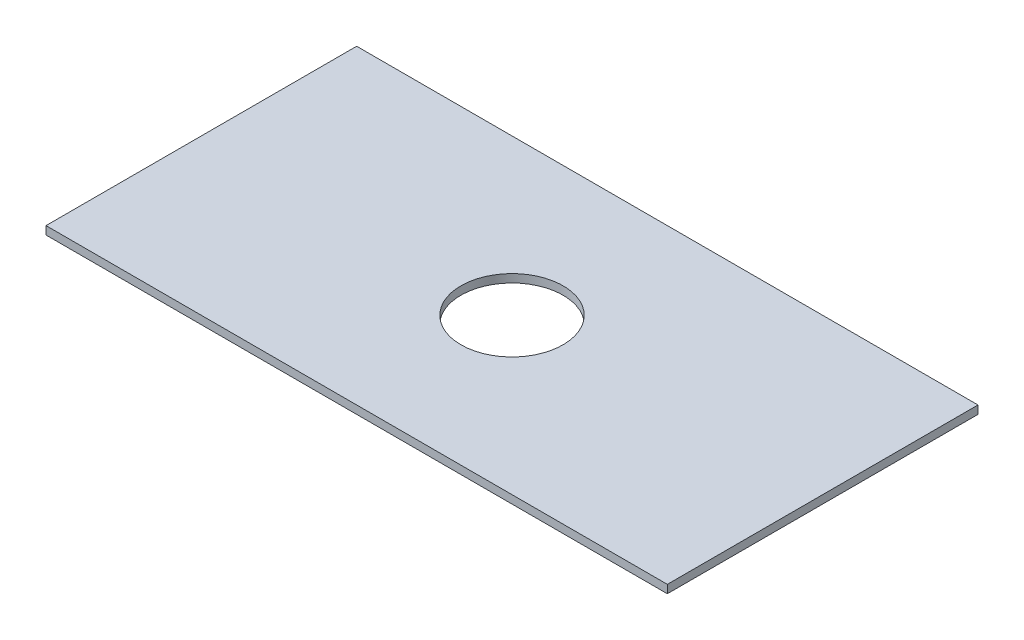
ISO-10303-21;
HEADER;
FILE_DESCRIPTION(('STEP AP214'),'2;1');
FILE_NAME('part.step','',(''),(''),'','','');
FILE_SCHEMA(('AUTOMOTIVE_DESIGN { 1 0 10303 214 1 1 1 1 }'));
ENDSEC;
DATA;
#1=APPLICATION_CONTEXT('core data for automotive mechanical design processes');
#2=APPLICATION_PROTOCOL_DEFINITION('international standard','automotive_design',2000,#1);
#3=PRODUCT_CONTEXT('',#1,'mechanical');
#4=PRODUCT('Part','Part','',(#3));
#5=PRODUCT_RELATED_PRODUCT_CATEGORY('part','',(#4));
#6=PRODUCT_DEFINITION_FORMATION('','',#4);
#7=PRODUCT_DEFINITION_CONTEXT('part definition',#1,'design');
#8=PRODUCT_DEFINITION('design','',#6,#7);
#9=PRODUCT_DEFINITION_SHAPE('','',#8);
#10=(LENGTH_UNIT() NAMED_UNIT(*) SI_UNIT(.MILLI.,.METRE.));
#11=(NAMED_UNIT(*) PLANE_ANGLE_UNIT() SI_UNIT($,.RADIAN.));
#12=(NAMED_UNIT(*) SI_UNIT($,.STERADIAN.) SOLID_ANGLE_UNIT());
#13=UNCERTAINTY_MEASURE_WITH_UNIT(LENGTH_MEASURE(1.E-05),#10,'distance_accuracy_value','');
#14=(GEOMETRIC_REPRESENTATION_CONTEXT(3) GLOBAL_UNCERTAINTY_ASSIGNED_CONTEXT((#13)) GLOBAL_UNIT_ASSIGNED_CONTEXT((#10,
#11,#12)) REPRESENTATION_CONTEXT('',''));
#15=CARTESIAN_POINT('',(0.,0.,0.));
#16=DIRECTION('',(0.,0.,1.));
#17=DIRECTION('',(1.,0.,0.));
#18=AXIS2_PLACEMENT_3D('',#15,#16,#17);
#19=CARTESIAN_POINT('',(-152.,4.,-75.9999999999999));
#20=DIRECTION('',(1.,0.,0.));
#21=DIRECTION('',(0.,0.,-1.));
#22=AXIS2_PLACEMENT_3D('',#19,#20,#21);
#23=PLANE('',#22);
#24=DIRECTION('',(0.,0.,1.));
#25=VECTOR('',#24,1.);
#26=CARTESIAN_POINT('',(-152.,0.,-75.9999999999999));
#27=LINE('',#26,#25);
#28=CARTESIAN_POINT('',(-152.,0.,-75.9999999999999));
#29=VERTEX_POINT('',#28);
#30=CARTESIAN_POINT('',(-152.,0.,76.0000000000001));
#31=VERTEX_POINT('',#30);
#32=EDGE_CURVE('E116',#29,#31,#27,.T.);
#33=ORIENTED_EDGE('',*,*,#32,.T.);
#34=DIRECTION('',(0.,-1.,0.));
#35=VECTOR('',#34,1.);
#36=CARTESIAN_POINT('',(-152.,4.,76.0000000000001));
#37=LINE('',#36,#35);
#38=CARTESIAN_POINT('',(-152.,4.,76.0000000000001));
#39=VERTEX_POINT('',#38);
#40=EDGE_CURVE('E12',#39,#31,#37,.T.);
#41=ORIENTED_EDGE('',*,*,#40,.F.);
#42=DIRECTION('',(0.,0.,1.));
#43=VECTOR('',#42,1.);
#44=CARTESIAN_POINT('',(-152.,4.,-75.9999999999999));
#45=LINE('',#44,#43);
#46=CARTESIAN_POINT('',(-152.,4.,-75.9999999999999));
#47=VERTEX_POINT('',#46);
#48=EDGE_CURVE('E93',#47,#39,#45,.T.);
#49=ORIENTED_EDGE('',*,*,#48,.F.);
#50=DIRECTION('',(0.,-1.,0.));
#51=VECTOR('',#50,1.);
#52=CARTESIAN_POINT('',(-152.,4.,-75.9999999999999));
#53=LINE('',#52,#51);
#54=EDGE_CURVE('E101',#47,#29,#53,.T.);
#55=ORIENTED_EDGE('',*,*,#54,.T.);
#56=EDGE_LOOP('',(#33,#41,#49,#55));
#57=FACE_BOUND('',#56,.T.);
#58=ADVANCED_FACE('F41',(#57),#23,.F.);
#59=CARTESIAN_POINT('',(-152.,4.,76.0000000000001));
#60=DIRECTION('',(0.,0.,-1.));
#61=DIRECTION('',(-1.,0.,0.));
#62=AXIS2_PLACEMENT_3D('',#59,#60,#61);
#63=PLANE('',#62);
#64=DIRECTION('',(1.,0.,0.));
#65=VECTOR('',#64,1.);
#66=CARTESIAN_POINT('',(-152.,0.,76.0000000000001));
#67=LINE('',#66,#65);
#68=CARTESIAN_POINT('',(152.,0.,76.));
#69=VERTEX_POINT('',#68);
#70=EDGE_CURVE('E97',#31,#69,#67,.T.);
#71=ORIENTED_EDGE('',*,*,#70,.T.);
#72=DIRECTION('',(0.,-1.,0.));
#73=VECTOR('',#72,1.);
#74=CARTESIAN_POINT('',(152.,4.,76.));
#75=LINE('',#74,#73);
#76=CARTESIAN_POINT('',(152.,4.,76.));
#77=VERTEX_POINT('',#76);
#78=EDGE_CURVE('E50',#77,#69,#75,.T.);
#79=ORIENTED_EDGE('',*,*,#78,.F.);
#80=DIRECTION('',(1.,0.,0.));
#81=VECTOR('',#80,1.);
#82=CARTESIAN_POINT('',(-152.,4.,76.0000000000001));
#83=LINE('',#82,#81);
#84=EDGE_CURVE('E88',#39,#77,#83,.T.);
#85=ORIENTED_EDGE('',*,*,#84,.F.);
#86=ORIENTED_EDGE('',*,*,#40,.T.);
#87=EDGE_LOOP('',(#71,#79,#85,#86));
#88=FACE_BOUND('',#87,.T.);
#89=ADVANCED_FACE('F96',(#88),#63,.F.);
#90=CARTESIAN_POINT('',(152.,4.,-76.));
#91=DIRECTION('',(-1.,0.,0.));
#92=DIRECTION('',(0.,0.,1.));
#93=AXIS2_PLACEMENT_3D('',#90,#91,#92);
#94=PLANE('',#93);
#95=DIRECTION('',(0.,0.,-1.));
#96=VECTOR('',#95,1.);
#97=CARTESIAN_POINT('',(152.,0.,-76.));
#98=LINE('',#97,#96);
#99=CARTESIAN_POINT('',(152.,0.,-76.));
#100=VERTEX_POINT('',#99);
#101=EDGE_CURVE('E75',#69,#100,#98,.T.);
#102=ORIENTED_EDGE('',*,*,#101,.T.);
#103=DIRECTION('',(0.,-1.,0.));
#104=VECTOR('',#103,1.);
#105=CARTESIAN_POINT('',(152.,4.,-76.));
#106=LINE('',#105,#104);
#107=CARTESIAN_POINT('',(152.,4.,-76.));
#108=VERTEX_POINT('',#107);
#109=EDGE_CURVE('E98',#108,#100,#106,.T.);
#110=ORIENTED_EDGE('',*,*,#109,.F.);
#111=DIRECTION('',(0.,0.,-1.));
#112=VECTOR('',#111,1.);
#113=CARTESIAN_POINT('',(152.,4.,-76.));
#114=LINE('',#113,#112);
#115=EDGE_CURVE('E91',#77,#108,#114,.T.);
#116=ORIENTED_EDGE('',*,*,#115,.F.);
#117=ORIENTED_EDGE('',*,*,#78,.T.);
#118=EDGE_LOOP('',(#102,#110,#116,#117));
#119=FACE_BOUND('',#118,.T.);
#120=ADVANCED_FACE('F99',(#119),#94,.F.);
#121=CARTESIAN_POINT('',(-152.,4.,-75.9999999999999));
#122=DIRECTION('',(0.,0.,1.));
#123=DIRECTION('',(1.,0.,0.));
#124=AXIS2_PLACEMENT_3D('',#121,#122,#123);
#125=PLANE('',#124);
#126=DIRECTION('',(-1.,0.,0.));
#127=VECTOR('',#126,1.);
#128=CARTESIAN_POINT('',(-152.,0.,-75.9999999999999));
#129=LINE('',#128,#127);
#130=EDGE_CURVE('E81',#100,#29,#129,.T.);
#131=ORIENTED_EDGE('',*,*,#130,.T.);
#132=ORIENTED_EDGE('',*,*,#54,.F.);
#133=DIRECTION('',(-1.,0.,0.));
#134=VECTOR('',#133,1.);
#135=CARTESIAN_POINT('',(-152.,4.,-75.9999999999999));
#136=LINE('',#135,#134);
#137=EDGE_CURVE('E58',#108,#47,#136,.T.);
#138=ORIENTED_EDGE('',*,*,#137,.F.);
#139=ORIENTED_EDGE('',*,*,#109,.T.);
#140=EDGE_LOOP('',(#131,#132,#138,#139));
#141=FACE_BOUND('',#140,.T.);
#142=ADVANCED_FACE('F133',(#141),#125,.F.);
#143=CARTESIAN_POINT('',(0.,4.,0.));
#144=DIRECTION('',(0.,1.,0.));
#145=DIRECTION('',(0.,0.,1.));
#146=AXIS2_PLACEMENT_3D('',#143,#144,#145);
#147=PLANE('',#146);
#148=CARTESIAN_POINT('',(0.,4.,0.));
#149=DIRECTION('',(0.,1.,0.));
#150=DIRECTION('',(0.,0.,1.));
#151=AXIS2_PLACEMENT_3D('',#148,#149,#150);
#152=CIRCLE('',#151,25.);
#153=CARTESIAN_POINT('',(0.,4.,25.));
#154=VERTEX_POINT('',#153);
#155=EDGE_CURVE('E121',#154,#154,#152,.T.);
#156=ORIENTED_EDGE('',*,*,#155,.F.);
#157=EDGE_LOOP('',(#156));
#158=FACE_BOUND('',#157,.T.);
#159=ORIENTED_EDGE('',*,*,#48,.T.);
#160=ORIENTED_EDGE('',*,*,#84,.T.);
#161=ORIENTED_EDGE('',*,*,#115,.T.);
#162=ORIENTED_EDGE('',*,*,#137,.T.);
#163=EDGE_LOOP('',(#159,#160,#161,#162));
#164=FACE_BOUND('',#163,.T.);
#165=ADVANCED_FACE('F89',(#158,#164),#147,.T.);
#166=CARTESIAN_POINT('',(0.,0.,0.));
#167=DIRECTION('',(0.,1.,0.));
#168=DIRECTION('',(0.,0.,1.));
#169=AXIS2_PLACEMENT_3D('',#166,#167,#168);
#170=PLANE('',#169);
#171=CARTESIAN_POINT('',(0.,0.,0.));
#172=DIRECTION('',(0.,1.,0.));
#173=DIRECTION('',(0.,0.,1.));
#174=AXIS2_PLACEMENT_3D('',#171,#172,#173);
#175=CIRCLE('',#174,25.);
#176=CARTESIAN_POINT('',(0.,0.,25.));
#177=VERTEX_POINT('',#176);
#178=EDGE_CURVE('E44',#177,#177,#175,.T.);
#179=ORIENTED_EDGE('',*,*,#178,.T.);
#180=EDGE_LOOP('',(#179));
#181=FACE_BOUND('',#180,.T.);
#182=ORIENTED_EDGE('',*,*,#32,.F.);
#183=ORIENTED_EDGE('',*,*,#130,.F.);
#184=ORIENTED_EDGE('',*,*,#101,.F.);
#185=ORIENTED_EDGE('',*,*,#70,.F.);
#186=EDGE_LOOP('',(#182,#183,#184,#185));
#187=FACE_BOUND('',#186,.T.);
#188=ADVANCED_FACE('F132',(#181,#187),#170,.F.);
#189=CARTESIAN_POINT('',(0.,-6.,0.));
#190=DIRECTION('',(0.,1.,0.));
#191=DIRECTION('',(0.,0.,1.));
#192=AXIS2_PLACEMENT_3D('',#189,#190,#191);
#193=CYLINDRICAL_SURFACE('',#192,25.);
#194=ORIENTED_EDGE('',*,*,#155,.T.);
#195=EDGE_LOOP('',(#194));
#196=FACE_BOUND('',#195,.T.);
#197=ORIENTED_EDGE('',*,*,#178,.F.);
#198=EDGE_LOOP('',(#197));
#199=FACE_BOUND('',#198,.T.);
#200=ADVANCED_FACE('F128',(#196,#199),#193,.F.);
#201=CLOSED_SHELL('',(#58,#89,#120,#142,#165,#188,#200));
#202=MANIFOLD_SOLID_BREP('B2',#201);
#203=ADVANCED_BREP_SHAPE_REPRESENTATION('',(#18,#202),#14);
#204=SHAPE_DEFINITION_REPRESENTATION(#9,#203);
ENDSEC;
END-ISO-10303-21;
